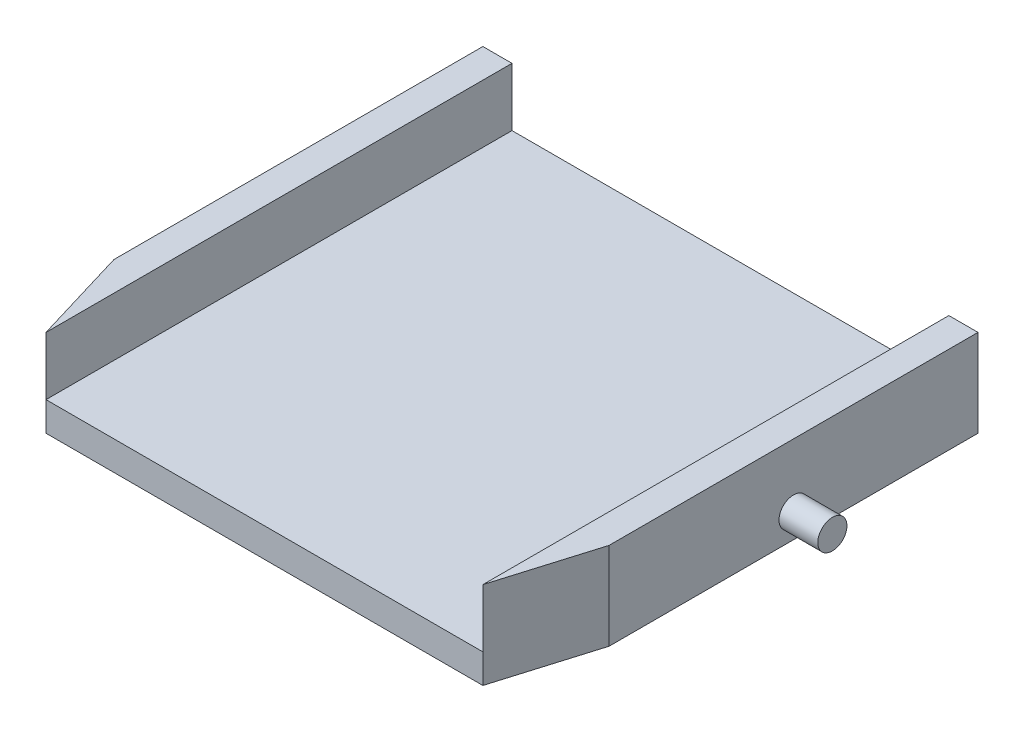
from build123d import *

# Parameters (mm, degrees)
BOSS_EXTRUDE2_DEPTH = 3
BOSS_EXTRUDE3_DEPTH = 6
SKETCH3_R           = 1.5
BOSS_EXTRUDE4_DEPTH = 4
BOSS_EXTRUDE5_START = 4
SKETCH4_R           = 1.5
BOSS_EXTRUDE5_DEPTH = 4


with BuildPart() as part:
    # Sketch1 → Boss-Extrude2 (new body)
    with BuildSketch(Plane(origin=(0, 0, 0), x_dir=(1, 0, 0), z_dir=(0, 1, 0))):
        Polygon((45, 0), (48, 10), (48, 48), (45, 48), (0, 48), (-3, 48), (-3, 10), (0, 0), align=None)
    extrude(amount=BOSS_EXTRUDE2_DEPTH)

    # Sketch2 → Boss-Extrude3 (add)
    with BuildSketch(Plane(origin=(0, 3, 0), x_dir=(1, 0, 0), z_dir=(0, 1, 0))):
        Polygon((0, 0), (0, 48), (-3, 48), (-3, 10), align=None)
        Polygon((45, 0), (48, 10), (48, 48), (45, 48), align=None)
    extrude(amount=BOSS_EXTRUDE3_DEPTH)

    # Sketch3 → Boss-Extrude4 (add)
    with BuildSketch(Plane(origin=(48, 0, 0), x_dir=(0, 0, -1), z_dir=(1, 0, 0))):
        with Locations(Location((29, 2.5, 0), (0, 0, 180))):
            Circle(SKETCH3_R)
    extrude(amount=BOSS_EXTRUDE4_DEPTH)

    # Sketch4 → Boss-Extrude5 (add)
    with BuildSketch(Plane.ZY.offset(3).offset(BOSS_EXTRUDE5_START)):
        with Locations((-29, 2.5)):
            Circle(SKETCH4_R)
    extrude(amount=-BOSS_EXTRUDE5_DEPTH)


solid = part.part
